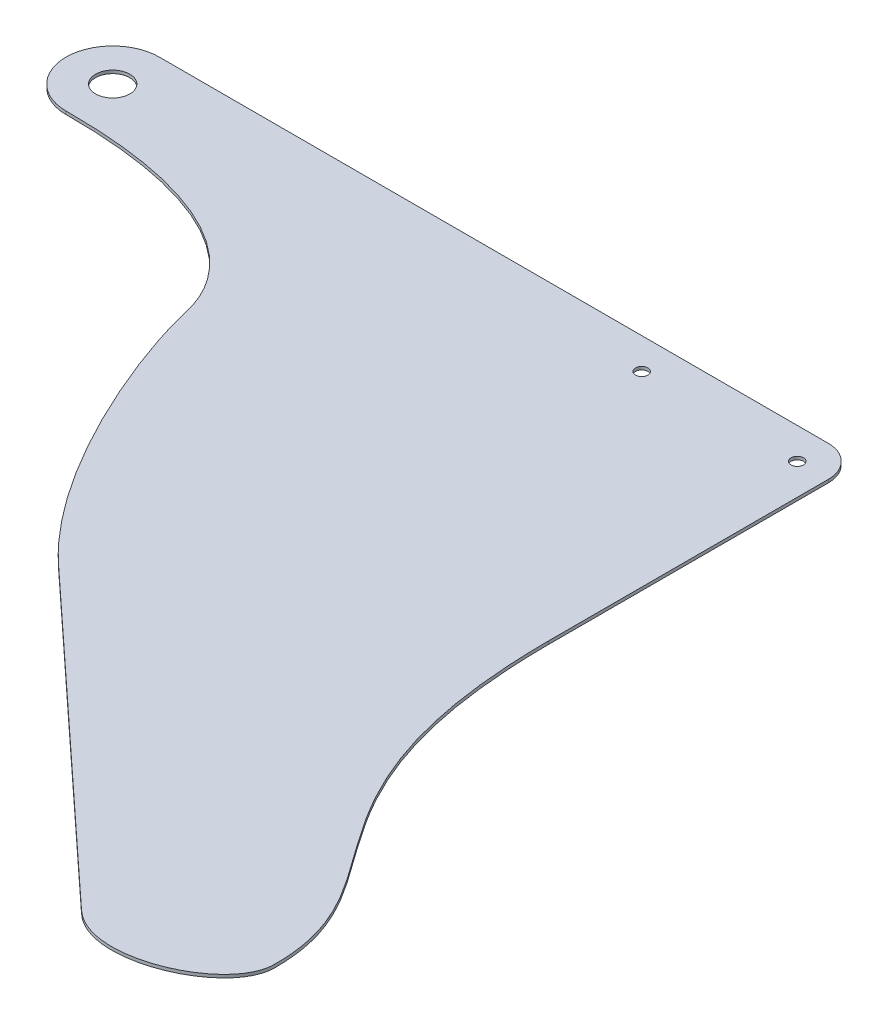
ISO-10303-21;
HEADER;
FILE_DESCRIPTION(('STEP AP214'),'2;1');
FILE_NAME('part.step','',(''),(''),'','','');
FILE_SCHEMA(('AUTOMOTIVE_DESIGN { 1 0 10303 214 1 1 1 1 }'));
ENDSEC;
DATA;
#1=APPLICATION_CONTEXT('core data for automotive mechanical design processes');
#2=APPLICATION_PROTOCOL_DEFINITION('international standard','automotive_design',2000,#1);
#3=PRODUCT_CONTEXT('',#1,'mechanical');
#4=PRODUCT('Part','Part','',(#3));
#5=PRODUCT_RELATED_PRODUCT_CATEGORY('part','',(#4));
#6=PRODUCT_DEFINITION_FORMATION('','',#4);
#7=PRODUCT_DEFINITION_CONTEXT('part definition',#1,'design');
#8=PRODUCT_DEFINITION('design','',#6,#7);
#9=PRODUCT_DEFINITION_SHAPE('','',#8);
#10=(LENGTH_UNIT() NAMED_UNIT(*) SI_UNIT(.MILLI.,.METRE.));
#11=(NAMED_UNIT(*) PLANE_ANGLE_UNIT() SI_UNIT($,.RADIAN.));
#12=(NAMED_UNIT(*) SI_UNIT($,.STERADIAN.) SOLID_ANGLE_UNIT());
#13=UNCERTAINTY_MEASURE_WITH_UNIT(LENGTH_MEASURE(1.E-05),#10,'distance_accuracy_value','');
#14=(GEOMETRIC_REPRESENTATION_CONTEXT(3) GLOBAL_UNCERTAINTY_ASSIGNED_CONTEXT((#13)) GLOBAL_UNIT_ASSIGNED_CONTEXT((#10,
#11,#12)) REPRESENTATION_CONTEXT('',''));
#15=CARTESIAN_POINT('',(0.,0.,0.));
#16=DIRECTION('',(0.,0.,1.));
#17=DIRECTION('',(1.,0.,0.));
#18=AXIS2_PLACEMENT_3D('',#15,#16,#17);
#19=CARTESIAN_POINT('',(0.,-0.5,125.));
#20=CARTESIAN_POINT('',(6.96807260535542,-0.5,131.524046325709));
#21=CARTESIAN_POINT('',(22.9817527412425,-0.5,124.689648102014));
#22=CARTESIAN_POINT('',(23.0530805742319,-0.5,94.631109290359));
#23=CARTESIAN_POINT('',(0.15115635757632,-0.5,94.0798875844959));
#24=CARTESIAN_POINT('',(0.,-0.5,50.));
#25=B_SPLINE_CURVE_WITH_KNOTS('',3,(#19,#20,#21,#22,#23,#24),.UNSPECIFIED.,.F.,.F.,(4,2,4),(0.,
0.255822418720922,1.),.UNSPECIFIED.);
#26=DIRECTION('',(0.,1.,0.));
#27=VECTOR('',#26,1.);
#28=SURFACE_OF_LINEAR_EXTRUSION('',#25,#27);
#29=CARTESIAN_POINT('',(0.,0.,125.));
#30=CARTESIAN_POINT('',(6.96807260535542,0.,131.524046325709));
#31=CARTESIAN_POINT('',(22.9817527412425,0.,124.689648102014));
#32=CARTESIAN_POINT('',(23.0530805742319,0.,94.631109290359));
#33=CARTESIAN_POINT('',(0.15115635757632,0.,94.0798875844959));
#34=CARTESIAN_POINT('',(0.,0.,50.));
#35=B_SPLINE_CURVE_WITH_KNOTS('',3,(#29,#30,#31,#32,#33,#34),.UNSPECIFIED.,.F.,.F.,(4,2,4),(0.,
0.255822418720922,1.),.UNSPECIFIED.);
#36=CARTESIAN_POINT('',(0.,0.,125.));
#37=VERTEX_POINT('',#36);
#38=CARTESIAN_POINT('',(0.,0.,50.));
#39=VERTEX_POINT('',#38);
#40=EDGE_CURVE('E85',#37,#39,#35,.T.);
#41=ORIENTED_EDGE('',*,*,#40,.F.);
#42=DIRECTION('',(0.,1.,0.));
#43=VECTOR('',#42,1.);
#44=CARTESIAN_POINT('',(0.,-0.5,125.));
#45=LINE('',#44,#43);
#46=CARTESIAN_POINT('',(0.,-0.5,125.));
#47=VERTEX_POINT('',#46);
#48=EDGE_CURVE('E11',#47,#37,#45,.T.);
#49=ORIENTED_EDGE('',*,*,#48,.F.);
#50=CARTESIAN_POINT('',(0.,-0.5,50.));
#51=VERTEX_POINT('',#50);
#52=EDGE_CURVE('E87',#47,#51,#25,.T.);
#53=ORIENTED_EDGE('',*,*,#52,.T.);
#54=DIRECTION('',(0.,1.,0.));
#55=VECTOR('',#54,1.);
#56=CARTESIAN_POINT('',(0.,-0.5,50.));
#57=LINE('',#56,#55);
#58=EDGE_CURVE('E30',#51,#39,#57,.T.);
#59=ORIENTED_EDGE('',*,*,#58,.T.);
#60=EDGE_LOOP('',(#41,#49,#53,#59));
#61=FACE_BOUND('',#60,.T.);
#62=ADVANCED_FACE('F26',(#61),#28,.T.);
#63=CARTESIAN_POINT('',(-50.,-0.5,78.7037037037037));
#64=DIRECTION('',(-0.679408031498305,0.,0.733760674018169));
#65=DIRECTION('',(0.733760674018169,0.,0.679408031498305));
#66=AXIS2_PLACEMENT_3D('',#63,#64,#65);
#67=PLANE('',#66);
#68=DIRECTION('',(0.733760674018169,0.,0.679408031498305));
#69=VECTOR('',#68,1.);
#70=CARTESIAN_POINT('',(-50.,0.,78.7037037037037));
#71=LINE('',#70,#69);
#72=CARTESIAN_POINT('',(-50.,0.,78.7037037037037));
#73=VERTEX_POINT('',#72);
#74=EDGE_CURVE('E103',#73,#37,#71,.T.);
#75=ORIENTED_EDGE('',*,*,#74,.F.);
#76=DIRECTION('',(0.,1.,0.));
#77=VECTOR('',#76,1.);
#78=CARTESIAN_POINT('',(-50.,-0.5,78.7037037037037));
#79=LINE('',#78,#77);
#80=CARTESIAN_POINT('',(-50.,-0.5,78.7037037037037));
#81=VERTEX_POINT('',#80);
#82=EDGE_CURVE('E35',#81,#73,#79,.T.);
#83=ORIENTED_EDGE('',*,*,#82,.F.);
#84=DIRECTION('',(0.733760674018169,0.,0.679408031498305));
#85=VECTOR('',#84,1.);
#86=CARTESIAN_POINT('',(-50.,-0.5,78.7037037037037));
#87=LINE('',#86,#85);
#88=EDGE_CURVE('E92',#81,#47,#87,.T.);
#89=ORIENTED_EDGE('',*,*,#88,.T.);
#90=ORIENTED_EDGE('',*,*,#48,.T.);
#91=EDGE_LOOP('',(#75,#83,#89,#90));
#92=FACE_BOUND('',#91,.T.);
#93=ADVANCED_FACE('F162',(#92),#67,.T.);
#94=CARTESIAN_POINT('',(-112.5,-0.5,15.));
#95=CARTESIAN_POINT('',(-86.7603443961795,-0.5,14.8543691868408));
#96=CARTESIAN_POINT('',(-76.9117432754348,-0.5,24.5638076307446));
#97=CARTESIAN_POINT('',(-72.6057673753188,-0.5,43.5653344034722));
#98=CARTESIAN_POINT('',(-63.3492485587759,-0.5,66.303918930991));
#99=CARTESIAN_POINT('',(-50.,-0.5,78.7037037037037));
#100=B_SPLINE_CURVE_WITH_KNOTS('',3,(#94,#95,#96,#97,#98,#99),.UNSPECIFIED.,.F.,.F.,(4,2,4),(0.,
0.443974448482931,1.),.UNSPECIFIED.);
#101=DIRECTION('',(0.,1.,0.));
#102=VECTOR('',#101,1.);
#103=SURFACE_OF_LINEAR_EXTRUSION('',#100,#102);
#104=CARTESIAN_POINT('',(-112.5,0.,15.));
#105=CARTESIAN_POINT('',(-86.7603443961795,0.,14.8543691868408));
#106=CARTESIAN_POINT('',(-76.9117432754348,0.,24.5638076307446));
#107=CARTESIAN_POINT('',(-72.6057673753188,0.,43.5653344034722));
#108=CARTESIAN_POINT('',(-63.3492485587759,0.,66.303918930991));
#109=CARTESIAN_POINT('',(-50.,0.,78.7037037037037));
#110=B_SPLINE_CURVE_WITH_KNOTS('',3,(#104,#105,#106,#107,#108,#109),.UNSPECIFIED.,.F.,.F.,(4,2,
4),(0.,0.443974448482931,1.),.UNSPECIFIED.);
#111=CARTESIAN_POINT('',(-112.5,0.,15.));
#112=VERTEX_POINT('',#111);
#113=EDGE_CURVE('E123',#112,#73,#110,.T.);
#114=ORIENTED_EDGE('',*,*,#113,.F.);
#115=DIRECTION('',(0.,1.,0.));
#116=VECTOR('',#115,1.);
#117=CARTESIAN_POINT('',(-112.5,-0.5,15.));
#118=LINE('',#117,#116);
#119=CARTESIAN_POINT('',(-112.5,-0.5,15.));
#120=VERTEX_POINT('',#119);
#121=EDGE_CURVE('E199',#120,#112,#118,.T.);
#122=ORIENTED_EDGE('',*,*,#121,.F.);
#123=EDGE_CURVE('E148',#120,#81,#100,.T.);
#124=ORIENTED_EDGE('',*,*,#123,.T.);
#125=ORIENTED_EDGE('',*,*,#82,.T.);
#126=EDGE_LOOP('',(#114,#122,#124,#125));
#127=FACE_BOUND('',#126,.T.);
#128=ADVANCED_FACE('F157',(#127),#103,.T.);
#129=CARTESIAN_POINT('',(-112.5,-0.5,7.5));
#130=DIRECTION('',(0.,1.,0.));
#131=DIRECTION('',(0.,0.,1.));
#132=AXIS2_PLACEMENT_3D('',#129,#130,#131);
#133=CYLINDRICAL_SURFACE('',#132,7.5);
#134=CARTESIAN_POINT('',(-112.5,0.,7.5));
#135=DIRECTION('',(0.,1.,0.));
#136=DIRECTION('',(0.,0.,1.));
#137=AXIS2_PLACEMENT_3D('',#134,#135,#136);
#138=CIRCLE('',#137,7.5);
#139=CARTESIAN_POINT('',(-112.5,0.,0.));
#140=VERTEX_POINT('',#139);
#141=EDGE_CURVE('E120',#140,#112,#138,.T.);
#142=ORIENTED_EDGE('',*,*,#141,.F.);
#143=DIRECTION('',(0.,1.,0.));
#144=VECTOR('',#143,1.);
#145=CARTESIAN_POINT('',(-112.5,-0.5,0.));
#146=LINE('',#145,#144);
#147=CARTESIAN_POINT('',(-112.5,-0.5,0.));
#148=VERTEX_POINT('',#147);
#149=EDGE_CURVE('E195',#148,#140,#146,.T.);
#150=ORIENTED_EDGE('',*,*,#149,.F.);
#151=CARTESIAN_POINT('',(-112.5,-0.5,7.5));
#152=DIRECTION('',(0.,1.,0.));
#153=DIRECTION('',(0.,0.,1.));
#154=AXIS2_PLACEMENT_3D('',#151,#152,#153);
#155=CIRCLE('',#154,7.5);
#156=EDGE_CURVE('E145',#148,#120,#155,.T.);
#157=ORIENTED_EDGE('',*,*,#156,.T.);
#158=ORIENTED_EDGE('',*,*,#121,.T.);
#159=EDGE_LOOP('',(#142,#150,#157,#158));
#160=FACE_BOUND('',#159,.T.);
#161=ADVANCED_FACE('F161',(#160),#133,.T.);
#162=CARTESIAN_POINT('',(-5.00000000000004,-0.5,0.));
#163=DIRECTION('',(0.,0.,-1.));
#164=DIRECTION('',(-1.,0.,0.));
#165=AXIS2_PLACEMENT_3D('',#162,#163,#164);
#166=PLANE('',#165);
#167=DIRECTION('',(-1.,0.,0.));
#168=VECTOR('',#167,1.);
#169=CARTESIAN_POINT('',(-5.00000000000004,0.,0.));
#170=LINE('',#169,#168);
#171=CARTESIAN_POINT('',(-5.00000000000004,0.,0.));
#172=VERTEX_POINT('',#171);
#173=EDGE_CURVE('E117',#172,#140,#170,.T.);
#174=ORIENTED_EDGE('',*,*,#173,.F.);
#175=DIRECTION('',(0.,1.,0.));
#176=VECTOR('',#175,1.);
#177=CARTESIAN_POINT('',(-5.00000000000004,-0.5,0.));
#178=LINE('',#177,#176);
#179=CARTESIAN_POINT('',(-5.00000000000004,-0.5,0.));
#180=VERTEX_POINT('',#179);
#181=EDGE_CURVE('E193',#180,#172,#178,.T.);
#182=ORIENTED_EDGE('',*,*,#181,.F.);
#183=DIRECTION('',(-1.,0.,0.));
#184=VECTOR('',#183,1.);
#185=CARTESIAN_POINT('',(-5.00000000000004,-0.5,0.));
#186=LINE('',#185,#184);
#187=EDGE_CURVE('E142',#180,#148,#186,.T.);
#188=ORIENTED_EDGE('',*,*,#187,.T.);
#189=ORIENTED_EDGE('',*,*,#149,.T.);
#190=EDGE_LOOP('',(#174,#182,#188,#189));
#191=FACE_BOUND('',#190,.T.);
#192=ADVANCED_FACE('F167',(#191),#166,.T.);
#193=CARTESIAN_POINT('',(-5.,-0.5,5.));
#194=DIRECTION('',(0.,1.,0.));
#195=DIRECTION('',(0.,0.,1.));
#196=AXIS2_PLACEMENT_3D('',#193,#194,#195);
#197=CYLINDRICAL_SURFACE('',#196,5.);
#198=CARTESIAN_POINT('',(-5.,0.,5.));
#199=DIRECTION('',(0.,1.,0.));
#200=DIRECTION('',(0.,0.,-1.));
#201=AXIS2_PLACEMENT_3D('',#198,#199,#200);
#202=CIRCLE('',#201,5.);
#203=CARTESIAN_POINT('',(0.,0.,5.00000000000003));
#204=VERTEX_POINT('',#203);
#205=EDGE_CURVE('E99',#204,#172,#202,.T.);
#206=ORIENTED_EDGE('',*,*,#205,.F.);
#207=DIRECTION('',(0.,1.,0.));
#208=VECTOR('',#207,1.);
#209=CARTESIAN_POINT('',(0.,-0.5,5.00000000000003));
#210=LINE('',#209,#208);
#211=CARTESIAN_POINT('',(0.,-0.5,5.00000000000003));
#212=VERTEX_POINT('',#211);
#213=EDGE_CURVE('E91',#212,#204,#210,.T.);
#214=ORIENTED_EDGE('',*,*,#213,.F.);
#215=CARTESIAN_POINT('',(-5.,-0.5,5.));
#216=DIRECTION('',(0.,1.,0.));
#217=DIRECTION('',(0.,0.,-1.));
#218=AXIS2_PLACEMENT_3D('',#215,#216,#217);
#219=CIRCLE('',#218,5.);
#220=EDGE_CURVE('E139',#212,#180,#219,.T.);
#221=ORIENTED_EDGE('',*,*,#220,.T.);
#222=ORIENTED_EDGE('',*,*,#181,.T.);
#223=EDGE_LOOP('',(#206,#214,#221,#222));
#224=FACE_BOUND('',#223,.T.);
#225=ADVANCED_FACE('F171',(#224),#197,.T.);
#226=CARTESIAN_POINT('',(0.,-0.5,5.00000000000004));
#227=DIRECTION('',(1.,0.,0.));
#228=DIRECTION('',(0.,0.,-1.));
#229=AXIS2_PLACEMENT_3D('',#226,#227,#228);
#230=PLANE('',#229);
#231=DIRECTION('',(0.,0.,-1.));
#232=VECTOR('',#231,1.);
#233=CARTESIAN_POINT('',(0.,0.,5.00000000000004));
#234=LINE('',#233,#232);
#235=EDGE_CURVE('E94',#39,#204,#234,.T.);
#236=ORIENTED_EDGE('',*,*,#235,.F.);
#237=ORIENTED_EDGE('',*,*,#58,.F.);
#238=DIRECTION('',(0.,0.,-1.));
#239=VECTOR('',#238,1.);
#240=CARTESIAN_POINT('',(0.,-0.5,5.00000000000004));
#241=LINE('',#240,#239);
#242=EDGE_CURVE('E134',#51,#212,#241,.T.);
#243=ORIENTED_EDGE('',*,*,#242,.T.);
#244=ORIENTED_EDGE('',*,*,#213,.T.);
#245=EDGE_LOOP('',(#236,#237,#243,#244));
#246=FACE_BOUND('',#245,.T.);
#247=ADVANCED_FACE('F95',(#246),#230,.T.);
#248=CARTESIAN_POINT('',(17.2527503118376,-0.5,99.7194840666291));
#249=DIRECTION('',(0.,-1.,0.));
#250=DIRECTION('',(0.,0.,-1.));
#251=AXIS2_PLACEMENT_3D('',#248,#249,#250);
#252=PLANE('',#251);
#253=CARTESIAN_POINT('',(-30.,-0.5,5.));
#254=DIRECTION('',(0.,1.,0.));
#255=DIRECTION('',(0.,0.,1.));
#256=AXIS2_PLACEMENT_3D('',#253,#254,#255);
#257=CIRCLE('',#256,1.);
#258=CARTESIAN_POINT('',(-30.,-0.5,6.));
#259=VERTEX_POINT('',#258);
#260=EDGE_CURVE('E261',#259,#259,#257,.T.);
#261=ORIENTED_EDGE('',*,*,#260,.T.);
#262=EDGE_LOOP('',(#261));
#263=FACE_BOUND('',#262,.T.);
#264=CARTESIAN_POINT('',(-5.,-0.5,5.));
#265=DIRECTION('',(0.,1.,0.));
#266=DIRECTION('',(0.,0.,1.));
#267=AXIS2_PLACEMENT_3D('',#264,#265,#266);
#268=CIRCLE('',#267,1.);
#269=CARTESIAN_POINT('',(-5.,-0.5,6.));
#270=VERTEX_POINT('',#269);
#271=EDGE_CURVE('E271',#270,#270,#268,.T.);
#272=ORIENTED_EDGE('',*,*,#271,.T.);
#273=EDGE_LOOP('',(#272));
#274=FACE_BOUND('',#273,.T.);
#275=CARTESIAN_POINT('',(-112.5,-0.5,7.5));
#276=DIRECTION('',(0.,1.,0.));
#277=DIRECTION('',(0.,0.,1.));
#278=AXIS2_PLACEMENT_3D('',#275,#276,#277);
#279=CIRCLE('',#278,2.75000000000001);
#280=CARTESIAN_POINT('',(-112.5,-0.5,10.25));
#281=VERTEX_POINT('',#280);
#282=EDGE_CURVE('E104',#281,#281,#279,.T.);
#283=ORIENTED_EDGE('',*,*,#282,.T.);
#284=EDGE_LOOP('',(#283));
#285=FACE_BOUND('',#284,.T.);
#286=ORIENTED_EDGE('',*,*,#52,.F.);
#287=ORIENTED_EDGE('',*,*,#88,.F.);
#288=ORIENTED_EDGE('',*,*,#123,.F.);
#289=ORIENTED_EDGE('',*,*,#156,.F.);
#290=ORIENTED_EDGE('',*,*,#187,.F.);
#291=ORIENTED_EDGE('',*,*,#220,.F.);
#292=ORIENTED_EDGE('',*,*,#242,.F.);
#293=EDGE_LOOP('',(#286,#287,#288,#289,#290,#291,#292));
#294=FACE_BOUND('',#293,.T.);
#295=ADVANCED_FACE('F176',(#263,#274,#285,#294),#252,.T.);
#296=CARTESIAN_POINT('',(17.2527503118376,0.,99.7194840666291));
#297=DIRECTION('',(0.,-1.,0.));
#298=DIRECTION('',(0.,0.,-1.));
#299=AXIS2_PLACEMENT_3D('',#296,#297,#298);
#300=PLANE('',#299);
#301=CARTESIAN_POINT('',(-30.,0.,5.));
#302=DIRECTION('',(0.,1.,0.));
#303=DIRECTION('',(0.,0.,1.));
#304=AXIS2_PLACEMENT_3D('',#301,#302,#303);
#305=CIRCLE('',#304,1.);
#306=CARTESIAN_POINT('',(-30.,0.,6.));
#307=VERTEX_POINT('',#306);
#308=EDGE_CURVE('E264',#307,#307,#305,.T.);
#309=ORIENTED_EDGE('',*,*,#308,.F.);
#310=EDGE_LOOP('',(#309));
#311=FACE_BOUND('',#310,.T.);
#312=CARTESIAN_POINT('',(-5.,0.,5.));
#313=DIRECTION('',(0.,1.,0.));
#314=DIRECTION('',(0.,0.,1.));
#315=AXIS2_PLACEMENT_3D('',#312,#313,#314);
#316=CIRCLE('',#315,1.);
#317=CARTESIAN_POINT('',(-5.,0.,6.));
#318=VERTEX_POINT('',#317);
#319=EDGE_CURVE('E266',#318,#318,#316,.T.);
#320=ORIENTED_EDGE('',*,*,#319,.F.);
#321=EDGE_LOOP('',(#320));
#322=FACE_BOUND('',#321,.T.);
#323=CARTESIAN_POINT('',(-112.5,0.,7.5));
#324=DIRECTION('',(0.,1.,0.));
#325=DIRECTION('',(0.,0.,1.));
#326=AXIS2_PLACEMENT_3D('',#323,#324,#325);
#327=CIRCLE('',#326,2.75000000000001);
#328=CARTESIAN_POINT('',(-112.5,0.,10.25));
#329=VERTEX_POINT('',#328);
#330=EDGE_CURVE('E107',#329,#329,#327,.T.);
#331=ORIENTED_EDGE('',*,*,#330,.F.);
#332=EDGE_LOOP('',(#331));
#333=FACE_BOUND('',#332,.T.);
#334=ORIENTED_EDGE('',*,*,#40,.T.);
#335=ORIENTED_EDGE('',*,*,#235,.T.);
#336=ORIENTED_EDGE('',*,*,#205,.T.);
#337=ORIENTED_EDGE('',*,*,#173,.T.);
#338=ORIENTED_EDGE('',*,*,#141,.T.);
#339=ORIENTED_EDGE('',*,*,#113,.T.);
#340=ORIENTED_EDGE('',*,*,#74,.T.);
#341=EDGE_LOOP('',(#334,#335,#336,#337,#338,#339,#340));
#342=FACE_BOUND('',#341,.T.);
#343=ADVANCED_FACE('F101',(#311,#322,#333,#342),#300,.F.);
#344=CARTESIAN_POINT('',(-112.5,-0.5,7.5));
#345=DIRECTION('',(0.,1.,0.));
#346=DIRECTION('',(0.,0.,1.));
#347=AXIS2_PLACEMENT_3D('',#344,#345,#346);
#348=CYLINDRICAL_SURFACE('',#347,2.75000000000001);
#349=ORIENTED_EDGE('',*,*,#282,.F.);
#350=EDGE_LOOP('',(#349));
#351=FACE_BOUND('',#350,.T.);
#352=ORIENTED_EDGE('',*,*,#330,.T.);
#353=EDGE_LOOP('',(#352));
#354=FACE_BOUND('',#353,.T.);
#355=ADVANCED_FACE('F232',(#351,#354),#348,.F.);
#356=CARTESIAN_POINT('',(-5.,-0.5,5.));
#357=DIRECTION('',(0.,1.,0.));
#358=DIRECTION('',(0.,0.,1.));
#359=AXIS2_PLACEMENT_3D('',#356,#357,#358);
#360=CYLINDRICAL_SURFACE('',#359,1.);
#361=ORIENTED_EDGE('',*,*,#271,.F.);
#362=EDGE_LOOP('',(#361));
#363=FACE_BOUND('',#362,.T.);
#364=ORIENTED_EDGE('',*,*,#319,.T.);
#365=EDGE_LOOP('',(#364));
#366=FACE_BOUND('',#365,.T.);
#367=ADVANCED_FACE('F240',(#363,#366),#360,.F.);
#368=CARTESIAN_POINT('',(-30.,-0.5,5.));
#369=DIRECTION('',(0.,1.,0.));
#370=DIRECTION('',(0.,0.,1.));
#371=AXIS2_PLACEMENT_3D('',#368,#369,#370);
#372=CYLINDRICAL_SURFACE('',#371,1.);
#373=ORIENTED_EDGE('',*,*,#260,.F.);
#374=EDGE_LOOP('',(#373));
#375=FACE_BOUND('',#374,.T.);
#376=ORIENTED_EDGE('',*,*,#308,.T.);
#377=EDGE_LOOP('',(#376));
#378=FACE_BOUND('',#377,.T.);
#379=ADVANCED_FACE('F248',(#375,#378),#372,.F.);
#380=CLOSED_SHELL('',(#62,#93,#128,#161,#192,#225,#247,#295,#343,#355,#367,#379));
#381=MANIFOLD_SOLID_BREP('B2',#380);
#382=ADVANCED_BREP_SHAPE_REPRESENTATION('',(#18,#381),#14);
#383=SHAPE_DEFINITION_REPRESENTATION(#9,#382);
ENDSEC;
END-ISO-10303-21;
